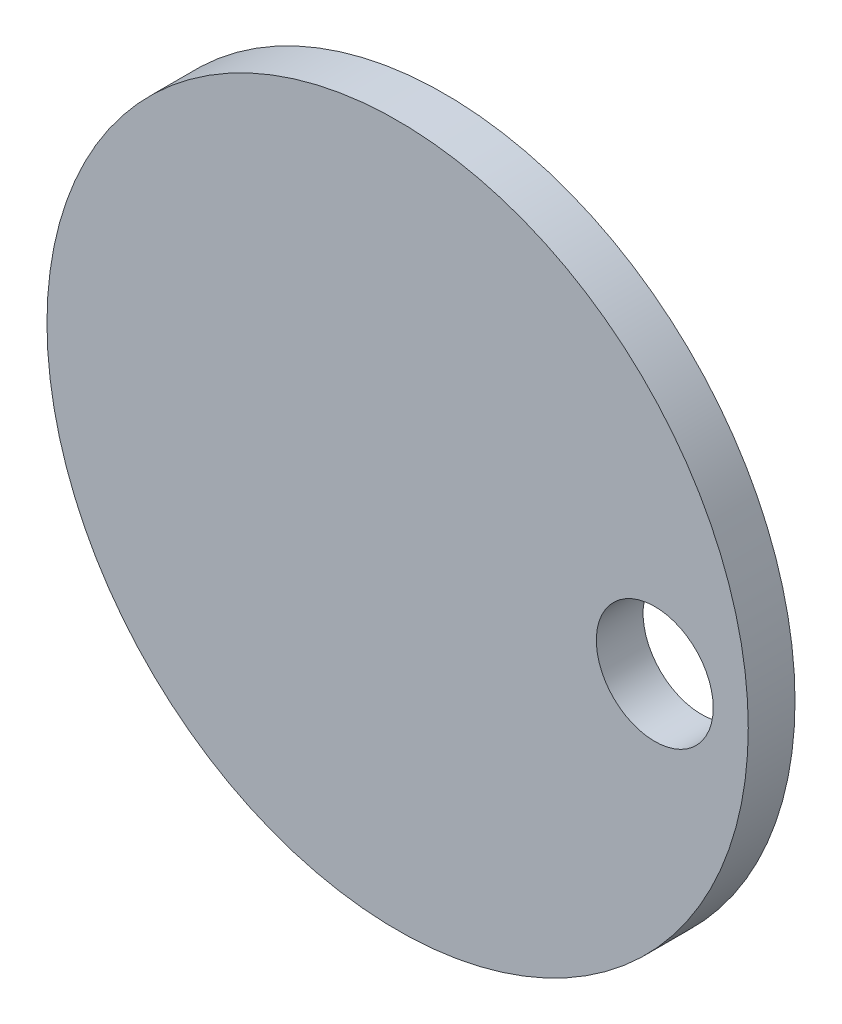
ISO-10303-21;
HEADER;
FILE_DESCRIPTION(('STEP AP214'),'2;1');
FILE_NAME('part.step','',(''),(''),'','','');
FILE_SCHEMA(('AUTOMOTIVE_DESIGN { 1 0 10303 214 1 1 1 1 }'));
ENDSEC;
DATA;
#1=APPLICATION_CONTEXT('core data for automotive mechanical design processes');
#2=APPLICATION_PROTOCOL_DEFINITION('international standard','automotive_design',2000,#1);
#3=PRODUCT_CONTEXT('',#1,'mechanical');
#4=PRODUCT('Part','Part','',(#3));
#5=PRODUCT_RELATED_PRODUCT_CATEGORY('part','',(#4));
#6=PRODUCT_DEFINITION_FORMATION('','',#4);
#7=PRODUCT_DEFINITION_CONTEXT('part definition',#1,'design');
#8=PRODUCT_DEFINITION('design','',#6,#7);
#9=PRODUCT_DEFINITION_SHAPE('','',#8);
#10=(LENGTH_UNIT() NAMED_UNIT(*) SI_UNIT(.MILLI.,.METRE.));
#11=(NAMED_UNIT(*) PLANE_ANGLE_UNIT() SI_UNIT($,.RADIAN.));
#12=(NAMED_UNIT(*) SI_UNIT($,.STERADIAN.) SOLID_ANGLE_UNIT());
#13=UNCERTAINTY_MEASURE_WITH_UNIT(LENGTH_MEASURE(1.E-05),#10,'distance_accuracy_value','');
#14=(GEOMETRIC_REPRESENTATION_CONTEXT(3) GLOBAL_UNCERTAINTY_ASSIGNED_CONTEXT((#13)) GLOBAL_UNIT_ASSIGNED_CONTEXT((#10,
#11,#12)) REPRESENTATION_CONTEXT('',''));
#15=CARTESIAN_POINT('',(0.,0.,0.));
#16=DIRECTION('',(0.,0.,1.));
#17=DIRECTION('',(1.,0.,0.));
#18=AXIS2_PLACEMENT_3D('',#15,#16,#17);
#19=CARTESIAN_POINT('',(0.,0.,2.));
#20=DIRECTION('',(0.,0.,1.));
#21=DIRECTION('',(1.,0.,0.));
#22=AXIS2_PLACEMENT_3D('',#19,#20,#21);
#23=PLANE('',#22);
#24=CARTESIAN_POINT('',(0.,0.,2.));
#25=DIRECTION('',(0.,0.,1.));
#26=DIRECTION('',(1.,0.,0.));
#27=AXIS2_PLACEMENT_3D('',#24,#25,#26);
#28=CIRCLE('',#27,15.);
#29=CARTESIAN_POINT('',(15.,0.,2.));
#30=VERTEX_POINT('',#29);
#31=EDGE_CURVE('E10',#30,#30,#28,.T.);
#32=ORIENTED_EDGE('',*,*,#31,.T.);
#33=EDGE_LOOP('',(#32));
#34=FACE_BOUND('',#33,.T.);
#35=CARTESIAN_POINT('',(11.,0.,2.));
#36=DIRECTION('',(0.,0.,1.));
#37=DIRECTION('',(1.,0.,0.));
#38=AXIS2_PLACEMENT_3D('',#35,#36,#37);
#39=CIRCLE('',#38,2.5);
#40=CARTESIAN_POINT('',(13.5,0.,2.));
#41=VERTEX_POINT('',#40);
#42=EDGE_CURVE('E1361',#41,#41,#39,.T.);
#43=ORIENTED_EDGE('',*,*,#42,.F.);
#44=EDGE_LOOP('',(#43));
#45=FACE_BOUND('',#44,.T.);
#46=ADVANCED_FACE('F1350',(#34,#45),#23,.T.);
#47=CARTESIAN_POINT('',(0.,0.,0.));
#48=DIRECTION('',(0.,0.,1.));
#49=DIRECTION('',(1.,0.,0.));
#50=AXIS2_PLACEMENT_3D('',#47,#48,#49);
#51=PLANE('',#50);
#52=CARTESIAN_POINT('',(0.,0.,0.));
#53=DIRECTION('',(0.,0.,1.));
#54=DIRECTION('',(1.,0.,0.));
#55=AXIS2_PLACEMENT_3D('',#52,#53,#54);
#56=CIRCLE('',#55,15.);
#57=CARTESIAN_POINT('',(15.,0.,0.));
#58=VERTEX_POINT('',#57);
#59=EDGE_CURVE('E1357',#58,#58,#56,.T.);
#60=ORIENTED_EDGE('',*,*,#59,.F.);
#61=EDGE_LOOP('',(#60));
#62=FACE_BOUND('',#61,.T.);
#63=CARTESIAN_POINT('',(11.,0.,0.));
#64=DIRECTION('',(0.,0.,1.));
#65=DIRECTION('',(1.,0.,0.));
#66=AXIS2_PLACEMENT_3D('',#63,#64,#65);
#67=CIRCLE('',#66,2.5);
#68=CARTESIAN_POINT('',(13.5,0.,0.));
#69=VERTEX_POINT('',#68);
#70=EDGE_CURVE('E1365',#69,#69,#67,.T.);
#71=ORIENTED_EDGE('',*,*,#70,.T.);
#72=EDGE_LOOP('',(#71));
#73=FACE_BOUND('',#72,.T.);
#74=ADVANCED_FACE('F1371',(#62,#73),#51,.F.);
#75=CARTESIAN_POINT('',(0.,0.,2.));
#76=DIRECTION('',(0.,0.,-1.));
#77=DIRECTION('',(-1.,0.,0.));
#78=AXIS2_PLACEMENT_3D('',#75,#76,#77);
#79=CYLINDRICAL_SURFACE('',#78,15.);
#80=ORIENTED_EDGE('',*,*,#31,.F.);
#81=EDGE_LOOP('',(#80));
#82=FACE_BOUND('',#81,.T.);
#83=ORIENTED_EDGE('',*,*,#59,.T.);
#84=EDGE_LOOP('',(#83));
#85=FACE_BOUND('',#84,.T.);
#86=ADVANCED_FACE('F1352',(#82,#85),#79,.T.);
#87=CARTESIAN_POINT('',(11.,0.,2.));
#88=DIRECTION('',(0.,0.,-1.));
#89=DIRECTION('',(-1.,0.,0.));
#90=AXIS2_PLACEMENT_3D('',#87,#88,#89);
#91=CYLINDRICAL_SURFACE('',#90,2.5);
#92=ORIENTED_EDGE('',*,*,#42,.T.);
#93=EDGE_LOOP('',(#92));
#94=FACE_BOUND('',#93,.T.);
#95=ORIENTED_EDGE('',*,*,#70,.F.);
#96=EDGE_LOOP('',(#95));
#97=FACE_BOUND('',#96,.T.);
#98=ADVANCED_FACE('F1373',(#94,#97),#91,.F.);
#99=CLOSED_SHELL('',(#46,#74,#86,#98));
#100=MANIFOLD_SOLID_BREP('B2',#99);
#101=ADVANCED_BREP_SHAPE_REPRESENTATION('',(#18,#100),#14);
#102=SHAPE_DEFINITION_REPRESENTATION(#9,#101);
ENDSEC;
END-ISO-10303-21;
